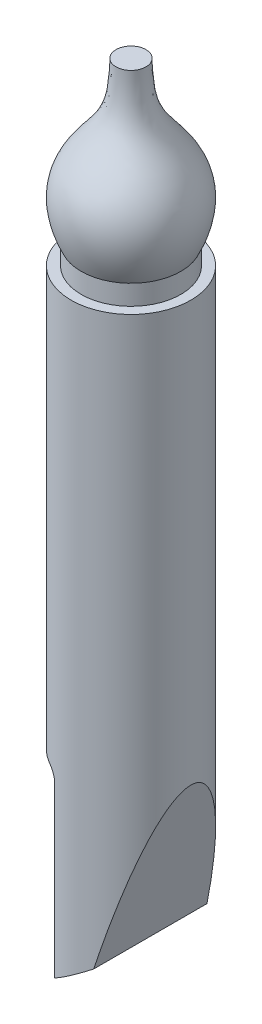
ISO-10303-21;
HEADER;
FILE_DESCRIPTION(('STEP AP214'),'2;1');
FILE_NAME('part.step','',(''),(''),'','','');
FILE_SCHEMA(('AUTOMOTIVE_DESIGN { 1 0 10303 214 1 1 1 1 }'));
ENDSEC;
DATA;
#1=APPLICATION_CONTEXT('core data for automotive mechanical design processes');
#2=APPLICATION_PROTOCOL_DEFINITION('international standard','automotive_design',2000,#1);
#3=PRODUCT_CONTEXT('',#1,'mechanical');
#4=PRODUCT('Part','Part','',(#3));
#5=PRODUCT_RELATED_PRODUCT_CATEGORY('part','',(#4));
#6=PRODUCT_DEFINITION_FORMATION('','',#4);
#7=PRODUCT_DEFINITION_CONTEXT('part definition',#1,'design');
#8=PRODUCT_DEFINITION('design','',#6,#7);
#9=PRODUCT_DEFINITION_SHAPE('','',#8);
#10=(LENGTH_UNIT() NAMED_UNIT(*) SI_UNIT(.MILLI.,.METRE.));
#11=(NAMED_UNIT(*) PLANE_ANGLE_UNIT() SI_UNIT($,.RADIAN.));
#12=(NAMED_UNIT(*) SI_UNIT($,.STERADIAN.) SOLID_ANGLE_UNIT());
#13=UNCERTAINTY_MEASURE_WITH_UNIT(LENGTH_MEASURE(1.E-05),#10,'distance_accuracy_value','');
#14=(GEOMETRIC_REPRESENTATION_CONTEXT(3) GLOBAL_UNCERTAINTY_ASSIGNED_CONTEXT((#13)) GLOBAL_UNIT_ASSIGNED_CONTEXT((#10,
#11,#12)) REPRESENTATION_CONTEXT('',''));
#15=CARTESIAN_POINT('',(0.,0.,0.));
#16=DIRECTION('',(0.,0.,1.));
#17=DIRECTION('',(1.,0.,0.));
#18=AXIS2_PLACEMENT_3D('',#15,#16,#17);
#19=CARTESIAN_POINT('',(0.,39.,0.));
#20=DIRECTION('',(0.,1.,0.));
#21=DIRECTION('',(0.,0.,1.));
#22=AXIS2_PLACEMENT_3D('',#19,#20,#21);
#23=CYLINDRICAL_SURFACE('',#22,3.);
#24=CARTESIAN_POINT('',(0.,30.,0.));
#25=DIRECTION('',(0.,1.,0.));
#26=DIRECTION('',(0.,0.,1.));
#27=AXIS2_PLACEMENT_3D('',#24,#25,#26);
#28=CIRCLE('',#27,3.);
#29=CARTESIAN_POINT('',(0.,30.,3.));
#30=VERTEX_POINT('',#29);
#31=EDGE_CURVE('E117',#30,#30,#28,.T.);
#32=ORIENTED_EDGE('',*,*,#31,.F.);
#33=EDGE_LOOP('',(#32));
#34=FACE_BOUND('',#33,.T.);
#35=DIRECTION('',(0.,1.,0.));
#36=VECTOR('',#35,1.);
#37=CARTESIAN_POINT('',(-1.,39.,2.82842712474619));
#38=LINE('',#37,#36);
#39=CARTESIAN_POINT('',(-1.,0.,2.82842712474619));
#40=VERTEX_POINT('',#39);
#41=CARTESIAN_POINT('',(-1.,8.5,2.82842712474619));
#42=VERTEX_POINT('',#41);
#43=EDGE_CURVE('E69',#40,#42,#38,.T.);
#44=ORIENTED_EDGE('',*,*,#43,.F.);
#45=CARTESIAN_POINT('',(0.,0.700207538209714,0.));
#46=DIRECTION('',(0.57357643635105,-0.819152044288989,0.));
#47=DIRECTION('',(0.819152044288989,0.57357643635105,0.));
#48=AXIS2_PLACEMENT_3D('',#45,#46,#47);
#49=ELLIPSE('',#48,3.66232376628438,3.);
#50=CARTESIAN_POINT('',(0.969521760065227,1.37907398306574,2.83901876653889));
#51=VERTEX_POINT('',#50);
#52=EDGE_CURVE('E120',#51,#40,#49,.T.);
#53=ORIENTED_EDGE('',*,*,#52,.F.);
#54=CARTESIAN_POINT('',(0.,-2.23923048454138,0.));
#55=DIRECTION('',(0.96592582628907,-0.258819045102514,0.));
#56=DIRECTION('',(0.258819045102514,0.96592582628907,0.));
#57=AXIS2_PLACEMENT_3D('',#54,#55,#56);
#58=ELLIPSE('',#57,11.5911099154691,3.);
#59=CARTESIAN_POINT('',(0.969521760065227,1.37907398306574,-2.8390187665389));
#60=VERTEX_POINT('',#59);
#61=EDGE_CURVE('E11',#60,#51,#58,.T.);
#62=ORIENTED_EDGE('',*,*,#61,.F.);
#63=CARTESIAN_POINT('',(-1.,0.,-2.82842712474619));
#64=VERTEX_POINT('',#63);
#65=EDGE_CURVE('E75',#64,#60,#49,.T.);
#66=ORIENTED_EDGE('',*,*,#65,.F.);
#67=DIRECTION('',(0.,1.,0.));
#68=VECTOR('',#67,1.);
#69=CARTESIAN_POINT('',(-1.,39.,-2.82842712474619));
#70=LINE('',#69,#68);
#71=CARTESIAN_POINT('',(-1.,8.49999999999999,-2.82842712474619));
#72=VERTEX_POINT('',#71);
#73=EDGE_CURVE('E76',#72,#64,#70,.F.);
#74=ORIENTED_EDGE('',*,*,#73,.F.);
#75=CARTESIAN_POINT('',(-1.,8.5,-2.82842712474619));
#76=CARTESIAN_POINT('',(-0.999970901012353,8.52678489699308,-2.82842652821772));
#77=CARTESIAN_POINT('',(-1.00215041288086,8.5535578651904,-2.82766670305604));
#78=CARTESIAN_POINT('',(-1.01070731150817,8.60628630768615,-2.82462519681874));
#79=CARTESIAN_POINT('',(-1.01707692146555,8.63224320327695,-2.82234633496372));
#80=CARTESIAN_POINT('',(-1.03379772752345,8.68265530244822,-2.81626281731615));
#81=CARTESIAN_POINT('',(-1.04414967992,8.70711021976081,-2.81245787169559));
#82=CARTESIAN_POINT('',(-1.06843424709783,8.75385909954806,-2.80332249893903));
#83=CARTESIAN_POINT('',(-1.08236721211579,8.77615285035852,-2.79799192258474));
#84=CARTESIAN_POINT('',(-1.11353532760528,8.81834477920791,-2.78573551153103));
#85=CARTESIAN_POINT('',(-1.13081691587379,8.83820196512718,-2.77878692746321));
#86=CARTESIAN_POINT('',(-1.16791543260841,8.87469612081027,-2.76339942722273));
#87=CARTESIAN_POINT('',(-1.187732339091,8.89133311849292,-2.75496052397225));
#88=CARTESIAN_POINT('',(-1.23029163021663,8.92187383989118,-2.73622889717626));
#89=CARTESIAN_POINT('',(-1.25313110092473,8.93559764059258,-2.72586419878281));
#90=CARTESIAN_POINT('',(-1.30016274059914,8.9590830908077,-2.70374817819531));
#91=CARTESIAN_POINT('',(-1.3243564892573,8.96883999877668,-2.69199521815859));
#92=CARTESIAN_POINT('',(-1.37381755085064,8.98452314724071,-2.66709583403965));
#93=CARTESIAN_POINT('',(-1.39909621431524,8.99037986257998,-2.65392874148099));
#94=CARTESIAN_POINT('',(-1.4496663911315,8.99811760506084,-2.62665375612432));
#95=CARTESIAN_POINT('',(-1.474957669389,9.00000974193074,-2.61254860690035));
#96=CARTESIAN_POINT('',(-1.5,9.,-2.59807621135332));
#97=B_SPLINE_CURVE_WITH_KNOTS('',3,(#75,#76,#77,#78,#79,#80,#81,#82,#83,#84,#85,#86,#87,#88,#89,
#90,#91,#92,#93,#94,#95,#96),.UNSPECIFIED.,.F.,.F.,(4,2,2,2,2,2,2,2,2,2,4),(0.,
0.0802373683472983,0.160326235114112,0.240430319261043,0.320542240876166,0.401856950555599,
0.483170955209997,0.56858144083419,0.654093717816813,0.741092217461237,0.827846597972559),.UNSPECIFIED.);
#98=CARTESIAN_POINT('',(-1.5,9.,-2.59807621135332));
#99=VERTEX_POINT('',#98);
#100=EDGE_CURVE('E80',#72,#99,#97,.T.);
#101=ORIENTED_EDGE('',*,*,#100,.T.);
#102=CARTESIAN_POINT('',(0.,9.,0.));
#103=DIRECTION('',(0.,1.,0.));
#104=DIRECTION('',(-1.,0.,0.));
#105=AXIS2_PLACEMENT_3D('',#102,#103,#104);
#106=CIRCLE('',#105,3.);
#107=CARTESIAN_POINT('',(-1.5,9.,2.59807621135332));
#108=VERTEX_POINT('',#107);
#109=EDGE_CURVE('E85',#99,#108,#106,.T.);
#110=ORIENTED_EDGE('',*,*,#109,.T.);
#111=CARTESIAN_POINT('',(-1.5,9.,2.59807621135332));
#112=CARTESIAN_POINT('',(-1.47085581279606,9.00002034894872,2.61492921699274));
#113=CARTESIAN_POINT('',(-1.44135552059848,8.99744963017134,2.63128095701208));
#114=CARTESIAN_POINT('',(-1.38245236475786,8.98690615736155,2.66268813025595));
#115=CARTESIAN_POINT('',(-1.35305067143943,8.97890720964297,2.67773687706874));
#116=CARTESIAN_POINT('',(-1.29534589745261,8.95724183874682,2.70612750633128));
#117=CARTESIAN_POINT('',(-1.26704745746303,8.94355381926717,2.71946262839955));
#118=CARTESIAN_POINT('',(-1.21295025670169,8.91061105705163,2.74401715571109));
#119=CARTESIAN_POINT('',(-1.18714561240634,8.89136986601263,2.75524160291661));
#120=CARTESIAN_POINT('',(-1.14168067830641,8.84993732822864,2.77436726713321));
#121=CARTESIAN_POINT('',(-1.12166308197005,8.82823993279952,2.78248958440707));
#122=CARTESIAN_POINT('',(-1.08552425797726,8.78122547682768,2.79678671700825));
#123=CARTESIAN_POINT('',(-1.06940384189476,8.75590766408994,2.80296112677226));
#124=CARTESIAN_POINT('',(-1.04300335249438,8.7047278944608,2.812885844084));
#125=CARTESIAN_POINT('',(-1.03234653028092,8.67909014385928,2.81679616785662));
#126=CARTESIAN_POINT('',(-1.01540694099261,8.6262400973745,2.82294724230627));
#127=CARTESIAN_POINT('',(-1.00911724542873,8.59903037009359,2.82519063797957));
#128=CARTESIAN_POINT('',(-1.00342529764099,8.55964418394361,2.82721420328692));
#129=CARTESIAN_POINT('',(-1.00214084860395,8.54774613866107,2.82766949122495));
#130=CARTESIAN_POINT('',(-1.0004290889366,8.5239007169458,2.82827549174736));
#131=CARTESIAN_POINT('',(-1.00000035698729,8.51195345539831,2.82842670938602));
#132=CARTESIAN_POINT('',(-1.,8.5,2.82842712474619));
#133=B_SPLINE_CURVE_WITH_KNOTS('',3,(#111,#112,#113,#114,#115,#116,#117,#118,#119,#120,#121,
#122,#123,#124,#125,#126,#127,#128,#129,#130,#131,#132),.UNSPECIFIED.,.F.,.F.,(4,2,2,2,2,2,2,2,
2,2,4),(0.,0.100983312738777,0.20245741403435,0.304320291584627,0.405936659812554,
0.497294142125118,0.588670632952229,0.672374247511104,0.755944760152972,0.791843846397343,
0.827683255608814),.UNSPECIFIED.);
#134=EDGE_CURVE('E38',#108,#42,#133,.T.);
#135=ORIENTED_EDGE('',*,*,#134,.T.);
#136=EDGE_LOOP('',(#44,#53,#62,#66,#74,#101,#110,#135));
#137=FACE_BOUND('',#136,.T.);
#138=ADVANCED_FACE('F30',(#34,#137),#23,.T.);
#139=CARTESIAN_POINT('',(0.75,39.,0.));
#140=DIRECTION('',(0.,-1.,0.));
#141=DIRECTION('',(0.,0.,-1.));
#142=AXIS2_PLACEMENT_3D('',#139,#140,#141);
#143=PLANE('',#142);
#144=CARTESIAN_POINT('',(0.,39.,0.));
#145=DIRECTION('',(0.,1.,0.));
#146=DIRECTION('',(0.,0.,1.));
#147=AXIS2_PLACEMENT_3D('',#144,#145,#146);
#148=CIRCLE('',#147,0.75);
#149=CARTESIAN_POINT('',(0.,39.,0.75));
#150=VERTEX_POINT('',#149);
#151=EDGE_CURVE('E108',#150,#150,#148,.T.);
#152=ORIENTED_EDGE('',*,*,#151,.T.);
#153=EDGE_LOOP('',(#152));
#154=FACE_BOUND('',#153,.T.);
#155=ADVANCED_FACE('F32',(#154),#143,.F.);
#156=CARTESIAN_POINT('',(2.49999999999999,31.,0.));
#157=CARTESIAN_POINT('',(3.62216646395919,33.3621251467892,0.));
#158=CARTESIAN_POINT('',(1.62304376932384,35.871683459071,0.));
#159=CARTESIAN_POINT('',(0.75,36.9949117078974,0.));
#160=CARTESIAN_POINT('',(0.75,39.,0.));
#161=B_SPLINE_CURVE_WITH_KNOTS('',3,(#156,#157,#158,#159,#160),.UNSPECIFIED.,.F.,.F.,(4,1,4),
(0.,0.508286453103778,1.),.UNSPECIFIED.);
#162=CARTESIAN_POINT('',(0.,39.,0.));
#163=DIRECTION('',(0.,1.,0.));
#164=AXIS1_PLACEMENT('',#162,#163);
#165=SURFACE_OF_REVOLUTION('',#161,#164);
#166=ORIENTED_EDGE('',*,*,#151,.F.);
#167=EDGE_LOOP('',(#166));
#168=FACE_BOUND('',#167,.T.);
#169=CARTESIAN_POINT('',(0.,31.,0.));
#170=DIRECTION('',(0.,1.,0.));
#171=DIRECTION('',(0.,0.,1.));
#172=AXIS2_PLACEMENT_3D('',#169,#170,#171);
#173=CIRCLE('',#172,2.5);
#174=CARTESIAN_POINT('',(0.,31.,2.5));
#175=VERTEX_POINT('',#174);
#176=EDGE_CURVE('E111',#175,#175,#173,.T.);
#177=ORIENTED_EDGE('',*,*,#176,.T.);
#178=EDGE_LOOP('',(#177));
#179=FACE_BOUND('',#178,.T.);
#180=ADVANCED_FACE('F128',(#168,#179),#165,.T.);
#181=CARTESIAN_POINT('',(0.,39.,0.));
#182=DIRECTION('',(0.,1.,0.));
#183=DIRECTION('',(0.,0.,1.));
#184=AXIS2_PLACEMENT_3D('',#181,#182,#183);
#185=CYLINDRICAL_SURFACE('',#184,2.5);
#186=ORIENTED_EDGE('',*,*,#176,.F.);
#187=EDGE_LOOP('',(#186));
#188=FACE_BOUND('',#187,.T.);
#189=CARTESIAN_POINT('',(0.,30.,0.));
#190=DIRECTION('',(0.,1.,0.));
#191=DIRECTION('',(0.,0.,1.));
#192=AXIS2_PLACEMENT_3D('',#189,#190,#191);
#193=CIRCLE('',#192,2.5);
#194=CARTESIAN_POINT('',(0.,30.,2.5));
#195=VERTEX_POINT('',#194);
#196=EDGE_CURVE('E114',#195,#195,#193,.T.);
#197=ORIENTED_EDGE('',*,*,#196,.T.);
#198=EDGE_LOOP('',(#197));
#199=FACE_BOUND('',#198,.T.);
#200=ADVANCED_FACE('F131',(#188,#199),#185,.T.);
#201=CARTESIAN_POINT('',(3.,30.,0.));
#202=DIRECTION('',(0.,-1.,0.));
#203=DIRECTION('',(0.,0.,-1.));
#204=AXIS2_PLACEMENT_3D('',#201,#202,#203);
#205=PLANE('',#204);
#206=ORIENTED_EDGE('',*,*,#196,.F.);
#207=EDGE_LOOP('',(#206));
#208=FACE_BOUND('',#207,.T.);
#209=ORIENTED_EDGE('',*,*,#31,.T.);
#210=EDGE_LOOP('',(#209));
#211=FACE_BOUND('',#210,.T.);
#212=ADVANCED_FACE('F134',(#208,#211),#205,.F.);
#213=CARTESIAN_POINT('',(-1.04696047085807,-6.14654015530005,-3.62216646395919));
#214=DIRECTION('',(0.96592582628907,-0.258819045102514,0.));
#215=DIRECTION('',(0.258819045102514,0.96592582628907,0.));
#216=AXIS2_PLACEMENT_3D('',#213,#214,#215);
#217=PLANE('',#216);
#218=ORIENTED_EDGE('',*,*,#61,.T.);
#219=DIRECTION('',(0.,0.,1.));
#220=VECTOR('',#219,1.);
#221=CARTESIAN_POINT('',(0.969521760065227,1.37907398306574,-3.62216646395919));
#222=LINE('',#221,#220);
#223=EDGE_CURVE('E217',#60,#51,#222,.T.);
#224=ORIENTED_EDGE('',*,*,#223,.F.);
#225=EDGE_LOOP('',(#218,#224));
#226=FACE_BOUND('',#225,.T.);
#227=ADVANCED_FACE('F137',(#226),#217,.T.);
#228=CARTESIAN_POINT('',(0.166428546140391,9.,-3.62216646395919));
#229=DIRECTION('',(0.,1.,0.));
#230=DIRECTION('',(-1.,0.,0.));
#231=AXIS2_PLACEMENT_3D('',#228,#229,#230);
#232=PLANE('',#231);
#233=DIRECTION('',(0.,0.,1.));
#234=VECTOR('',#233,1.);
#235=CARTESIAN_POINT('',(-1.5,9.,-3.62216646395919));
#236=LINE('',#235,#234);
#237=EDGE_CURVE('E82',#99,#108,#236,.T.);
#238=ORIENTED_EDGE('',*,*,#237,.T.);
#239=ORIENTED_EDGE('',*,*,#109,.F.);
#240=EDGE_LOOP('',(#238,#239));
#241=FACE_BOUND('',#240,.T.);
#242=ADVANCED_FACE('F101',(#241),#232,.F.);
#243=CARTESIAN_POINT('',(-1.5,8.5,-3.62216646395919));
#244=DIRECTION('',(0.,0.,1.));
#245=DIRECTION('',(1.,0.,0.));
#246=AXIS2_PLACEMENT_3D('',#243,#244,#245);
#247=CYLINDRICAL_SURFACE('',#246,0.5);
#248=ORIENTED_EDGE('',*,*,#237,.F.);
#249=ORIENTED_EDGE('',*,*,#100,.F.);
#250=DIRECTION('',(0.,0.,1.));
#251=VECTOR('',#250,1.);
#252=CARTESIAN_POINT('',(-1.,8.5,-3.62216646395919));
#253=LINE('',#252,#251);
#254=EDGE_CURVE('E45',#72,#42,#253,.T.);
#255=ORIENTED_EDGE('',*,*,#254,.T.);
#256=ORIENTED_EDGE('',*,*,#134,.F.);
#257=EDGE_LOOP('',(#248,#249,#255,#256));
#258=FACE_BOUND('',#257,.T.);
#259=ADVANCED_FACE('F78',(#258),#247,.F.);
#260=CARTESIAN_POINT('',(-3.25800344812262,-1.581071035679,-3.62216646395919));
#261=DIRECTION('',(0.57357643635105,-0.819152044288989,0.));
#262=DIRECTION('',(0.819152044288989,0.57357643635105,0.));
#263=AXIS2_PLACEMENT_3D('',#260,#261,#262);
#264=PLANE('',#263);
#265=ORIENTED_EDGE('',*,*,#52,.T.);
#266=DIRECTION('',(0.,0.,1.));
#267=VECTOR('',#266,1.);
#268=CARTESIAN_POINT('',(-1.,0.,-3.62216646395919));
#269=LINE('',#268,#267);
#270=EDGE_CURVE('E72',#64,#40,#269,.T.);
#271=ORIENTED_EDGE('',*,*,#270,.F.);
#272=ORIENTED_EDGE('',*,*,#65,.T.);
#273=ORIENTED_EDGE('',*,*,#223,.T.);
#274=EDGE_LOOP('',(#265,#271,#272,#273));
#275=FACE_BOUND('',#274,.T.);
#276=ADVANCED_FACE('F100',(#275),#264,.T.);
#277=CARTESIAN_POINT('',(-0.999999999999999,-6.47166676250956,-3.62216646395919));
#278=DIRECTION('',(-1.,0.,0.));
#279=DIRECTION('',(0.,-1.,0.));
#280=AXIS2_PLACEMENT_3D('',#277,#278,#279);
#281=PLANE('',#280);
#282=ORIENTED_EDGE('',*,*,#43,.T.);
#283=ORIENTED_EDGE('',*,*,#254,.F.);
#284=ORIENTED_EDGE('',*,*,#73,.T.);
#285=ORIENTED_EDGE('',*,*,#270,.T.);
#286=EDGE_LOOP('',(#282,#283,#284,#285));
#287=FACE_BOUND('',#286,.T.);
#288=ADVANCED_FACE('F70',(#287),#281,.T.);
#289=CLOSED_SHELL('',(#138,#155,#180,#200,#212,#227,#242,#259,#276,#288));
#290=MANIFOLD_SOLID_BREP('B2',#289);
#291=ADVANCED_BREP_SHAPE_REPRESENTATION('',(#18,#290),#14);
#292=SHAPE_DEFINITION_REPRESENTATION(#9,#291);
ENDSEC;
END-ISO-10303-21;
